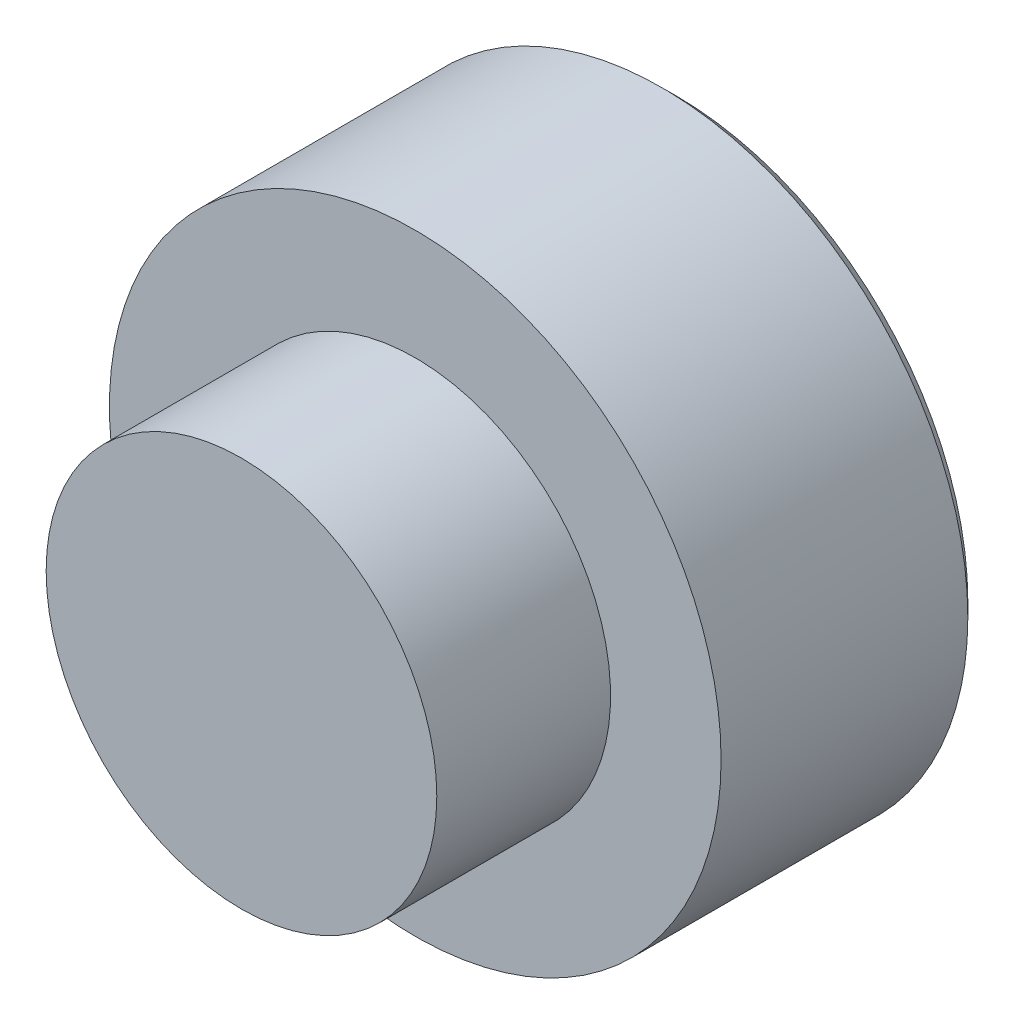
from build123d import *

# Parameters (mm, degrees)
SKETCH1_R           = 3.5687
BOSS_EXTRUDE1_DEPTH = 3.175
SKETCH2_R           = 5.588
BOSS_EXTRUDE2_DEPTH = 4.7625
CHAMFER1_SIZE       = 0.254


with BuildPart() as part:
    # Sketch1 → Boss-Extrude1 (new body)
    with BuildSketch(Plane.XY):
        Circle(SKETCH1_R)
    extrude(amount=BOSS_EXTRUDE1_DEPTH)

    # Sketch2 → Boss-Extrude2 (add)
    with BuildSketch(Plane(origin=(0, 0, 0), x_dir=(-1, 0, 0), z_dir=(0, 0, -1))):
        with Locations(Location((0, 0, 0), (0, 0, 180))):
            Circle(SKETCH2_R)
    extrude(amount=BOSS_EXTRUDE2_DEPTH)

    # Chamfer1
    chamfer1_edges = [part.edges().sort_by_distance(p)[0] for p in [
        (-5.588, 0, -4.7625),
    ]]
    chamfer(chamfer1_edges, length=CHAMFER1_SIZE)


solid = part.part
